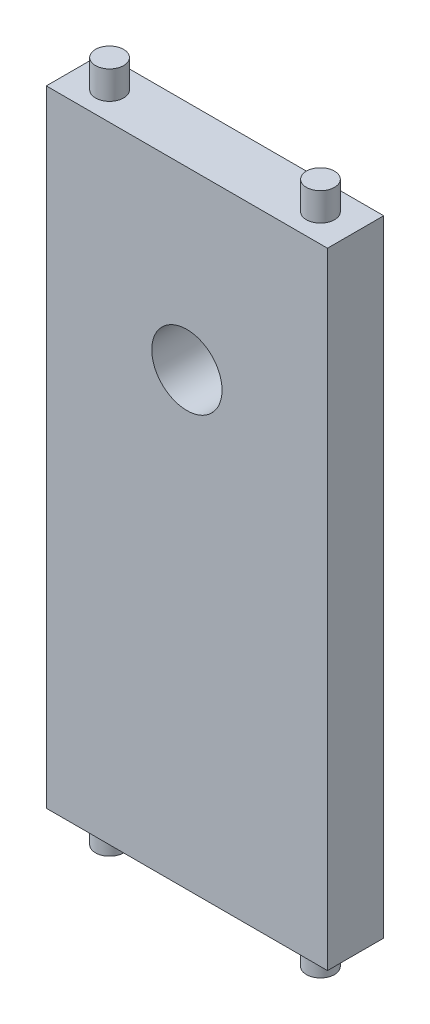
ISO-10303-21;
HEADER;
FILE_DESCRIPTION(('STEP AP214'),'2;1');
FILE_NAME('part.step','',(''),(''),'','','');
FILE_SCHEMA(('AUTOMOTIVE_DESIGN { 1 0 10303 214 1 1 1 1 }'));
ENDSEC;
DATA;
#1=APPLICATION_CONTEXT('core data for automotive mechanical design processes');
#2=APPLICATION_PROTOCOL_DEFINITION('international standard','automotive_design',2000,#1);
#3=PRODUCT_CONTEXT('',#1,'mechanical');
#4=PRODUCT('Part','Part','',(#3));
#5=PRODUCT_RELATED_PRODUCT_CATEGORY('part','',(#4));
#6=PRODUCT_DEFINITION_FORMATION('','',#4);
#7=PRODUCT_DEFINITION_CONTEXT('part definition',#1,'design');
#8=PRODUCT_DEFINITION('design','',#6,#7);
#9=PRODUCT_DEFINITION_SHAPE('','',#8);
#10=(LENGTH_UNIT() NAMED_UNIT(*) SI_UNIT(.MILLI.,.METRE.));
#11=(NAMED_UNIT(*) PLANE_ANGLE_UNIT() SI_UNIT($,.RADIAN.));
#12=(NAMED_UNIT(*) SI_UNIT($,.STERADIAN.) SOLID_ANGLE_UNIT());
#13=UNCERTAINTY_MEASURE_WITH_UNIT(LENGTH_MEASURE(1.E-05),#10,'distance_accuracy_value','');
#14=(GEOMETRIC_REPRESENTATION_CONTEXT(3) GLOBAL_UNCERTAINTY_ASSIGNED_CONTEXT((#13)) GLOBAL_UNIT_ASSIGNED_CONTEXT((#10,
#11,#12)) REPRESENTATION_CONTEXT('',''));
#15=CARTESIAN_POINT('',(0.,0.,0.));
#16=DIRECTION('',(0.,0.,1.));
#17=DIRECTION('',(1.,0.,0.));
#18=AXIS2_PLACEMENT_3D('',#15,#16,#17);
#19=CARTESIAN_POINT('',(-10.,22.25,4.));
#20=DIRECTION('',(0.,-1.,0.));
#21=DIRECTION('',(0.,0.,-1.));
#22=AXIS2_PLACEMENT_3D('',#19,#20,#21);
#23=PLANE('',#22);
#24=CARTESIAN_POINT('',(-7.5,22.25,2.));
#25=DIRECTION('',(0.,-1.,0.));
#26=DIRECTION('',(0.,0.,-1.));
#27=AXIS2_PLACEMENT_3D('',#24,#25,#26);
#28=CIRCLE('',#27,1.);
#29=CARTESIAN_POINT('',(-7.5,22.25,1.));
#30=VERTEX_POINT('',#29);
#31=EDGE_CURVE('E42',#30,#30,#28,.F.);
#32=ORIENTED_EDGE('',*,*,#31,.F.);
#33=EDGE_LOOP('',(#32));
#34=FACE_BOUND('',#33,.T.);
#35=DIRECTION('',(-1.,0.,0.));
#36=VECTOR('',#35,1.);
#37=CARTESIAN_POINT('',(-10.,22.25,0.));
#38=LINE('',#37,#36);
#39=CARTESIAN_POINT('',(9.99999999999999,22.25,0.));
#40=VERTEX_POINT('',#39);
#41=CARTESIAN_POINT('',(-10.,22.25,0.));
#42=VERTEX_POINT('',#41);
#43=EDGE_CURVE('E92',#40,#42,#38,.T.);
#44=ORIENTED_EDGE('',*,*,#43,.T.);
#45=DIRECTION('',(0.,0.,-1.));
#46=VECTOR('',#45,1.);
#47=CARTESIAN_POINT('',(-10.,22.25,4.));
#48=LINE('',#47,#46);
#49=CARTESIAN_POINT('',(-10.,22.25,4.));
#50=VERTEX_POINT('',#49);
#51=EDGE_CURVE('E90',#50,#42,#48,.T.);
#52=ORIENTED_EDGE('',*,*,#51,.F.);
#53=DIRECTION('',(-1.,0.,0.));
#54=VECTOR('',#53,1.);
#55=CARTESIAN_POINT('',(-10.,22.25,4.));
#56=LINE('',#55,#54);
#57=CARTESIAN_POINT('',(9.99999999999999,22.25,4.));
#58=VERTEX_POINT('',#57);
#59=EDGE_CURVE('E81',#58,#50,#56,.T.);
#60=ORIENTED_EDGE('',*,*,#59,.F.);
#61=DIRECTION('',(0.,0.,-1.));
#62=VECTOR('',#61,1.);
#63=CARTESIAN_POINT('',(9.99999999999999,22.25,4.));
#64=LINE('',#63,#62);
#65=EDGE_CURVE('E93',#58,#40,#64,.T.);
#66=ORIENTED_EDGE('',*,*,#65,.T.);
#67=EDGE_LOOP('',(#44,#52,#60,#66));
#68=FACE_BOUND('',#67,.T.);
#69=CARTESIAN_POINT('',(7.5,22.25,2.));
#70=DIRECTION('',(0.,-1.,0.));
#71=DIRECTION('',(0.,0.,-1.));
#72=AXIS2_PLACEMENT_3D('',#69,#70,#71);
#73=CIRCLE('',#72,1.);
#74=CARTESIAN_POINT('',(7.5,22.25,0.999999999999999));
#75=VERTEX_POINT('',#74);
#76=EDGE_CURVE('E11',#75,#75,#73,.F.);
#77=ORIENTED_EDGE('',*,*,#76,.F.);
#78=EDGE_LOOP('',(#77));
#79=FACE_BOUND('',#78,.T.);
#80=ADVANCED_FACE('F33',(#34,#68,#79),#23,.F.);
#81=CARTESIAN_POINT('',(0.,0.,4.));
#82=DIRECTION('',(0.,0.,-1.));
#83=DIRECTION('',(-1.,0.,0.));
#84=AXIS2_PLACEMENT_3D('',#81,#82,#83);
#85=PLANE('',#84);
#86=DIRECTION('',(0.,1.,0.));
#87=VECTOR('',#86,1.);
#88=CARTESIAN_POINT('',(9.99999999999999,-22.25,4.));
#89=LINE('',#88,#87);
#90=CARTESIAN_POINT('',(9.99999999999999,-22.25,4.));
#91=VERTEX_POINT('',#90);
#92=EDGE_CURVE('E87',#91,#58,#89,.T.);
#93=ORIENTED_EDGE('',*,*,#92,.T.);
#94=ORIENTED_EDGE('',*,*,#59,.T.);
#95=DIRECTION('',(0.,-1.,0.));
#96=VECTOR('',#95,1.);
#97=CARTESIAN_POINT('',(-10.,-22.25,4.));
#98=LINE('',#97,#96);
#99=CARTESIAN_POINT('',(-10.,-22.25,4.));
#100=VERTEX_POINT('',#99);
#101=EDGE_CURVE('E85',#50,#100,#98,.T.);
#102=ORIENTED_EDGE('',*,*,#101,.T.);
#103=DIRECTION('',(1.,0.,0.));
#104=VECTOR('',#103,1.);
#105=CARTESIAN_POINT('',(-10.,-22.25,4.));
#106=LINE('',#105,#104);
#107=EDGE_CURVE('E50',#100,#91,#106,.T.);
#108=ORIENTED_EDGE('',*,*,#107,.T.);
#109=EDGE_LOOP('',(#93,#94,#102,#108));
#110=FACE_BOUND('',#109,.T.);
#111=CARTESIAN_POINT('',(0.,9.74999999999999,4.));
#112=DIRECTION('',(0.,0.,1.));
#113=DIRECTION('',(1.,0.,0.));
#114=AXIS2_PLACEMENT_3D('',#111,#112,#113);
#115=CIRCLE('',#114,2.5);
#116=CARTESIAN_POINT('',(2.5,9.74999999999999,4.));
#117=VERTEX_POINT('',#116);
#118=EDGE_CURVE('E105',#117,#117,#115,.T.);
#119=ORIENTED_EDGE('',*,*,#118,.F.);
#120=EDGE_LOOP('',(#119));
#121=FACE_BOUND('',#120,.T.);
#122=ADVANCED_FACE('F82',(#110,#121),#85,.F.);
#123=CARTESIAN_POINT('',(0.,0.,0.));
#124=DIRECTION('',(0.,0.,-1.));
#125=DIRECTION('',(-1.,0.,0.));
#126=AXIS2_PLACEMENT_3D('',#123,#124,#125);
#127=PLANE('',#126);
#128=DIRECTION('',(0.,1.,0.));
#129=VECTOR('',#128,1.);
#130=CARTESIAN_POINT('',(9.99999999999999,-22.25,0.));
#131=LINE('',#130,#129);
#132=CARTESIAN_POINT('',(9.99999999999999,-22.25,0.));
#133=VERTEX_POINT('',#132);
#134=EDGE_CURVE('E102',#133,#40,#131,.T.);
#135=ORIENTED_EDGE('',*,*,#134,.F.);
#136=DIRECTION('',(1.,0.,0.));
#137=VECTOR('',#136,1.);
#138=CARTESIAN_POINT('',(-10.,-22.25,0.));
#139=LINE('',#138,#137);
#140=CARTESIAN_POINT('',(-10.,-22.25,0.));
#141=VERTEX_POINT('',#140);
#142=EDGE_CURVE('E73',#141,#133,#139,.T.);
#143=ORIENTED_EDGE('',*,*,#142,.F.);
#144=DIRECTION('',(0.,-1.,0.));
#145=VECTOR('',#144,1.);
#146=CARTESIAN_POINT('',(-10.,-22.25,0.));
#147=LINE('',#146,#145);
#148=EDGE_CURVE('E67',#42,#141,#147,.T.);
#149=ORIENTED_EDGE('',*,*,#148,.F.);
#150=ORIENTED_EDGE('',*,*,#43,.F.);
#151=EDGE_LOOP('',(#135,#143,#149,#150));
#152=FACE_BOUND('',#151,.T.);
#153=CARTESIAN_POINT('',(0.,9.74999999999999,0.));
#154=DIRECTION('',(0.,0.,1.));
#155=DIRECTION('',(1.,0.,0.));
#156=AXIS2_PLACEMENT_3D('',#153,#154,#155);
#157=CIRCLE('',#156,2.5);
#158=CARTESIAN_POINT('',(2.5,9.74999999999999,0.));
#159=VERTEX_POINT('',#158);
#160=EDGE_CURVE('E188',#159,#159,#157,.T.);
#161=ORIENTED_EDGE('',*,*,#160,.T.);
#162=EDGE_LOOP('',(#161));
#163=FACE_BOUND('',#162,.T.);
#164=ADVANCED_FACE('F120',(#152,#163),#127,.T.);
#165=CARTESIAN_POINT('',(9.99999999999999,-22.25,4.));
#166=DIRECTION('',(-1.,0.,0.));
#167=DIRECTION('',(0.,0.,1.));
#168=AXIS2_PLACEMENT_3D('',#165,#166,#167);
#169=PLANE('',#168);
#170=ORIENTED_EDGE('',*,*,#134,.T.);
#171=ORIENTED_EDGE('',*,*,#65,.F.);
#172=ORIENTED_EDGE('',*,*,#92,.F.);
#173=DIRECTION('',(0.,0.,-1.));
#174=VECTOR('',#173,1.);
#175=CARTESIAN_POINT('',(9.99999999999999,-22.25,4.));
#176=LINE('',#175,#174);
#177=EDGE_CURVE('E98',#91,#133,#176,.T.);
#178=ORIENTED_EDGE('',*,*,#177,.T.);
#179=EDGE_LOOP('',(#170,#171,#172,#178));
#180=FACE_BOUND('',#179,.T.);
#181=ADVANCED_FACE('F35',(#180),#169,.F.);
#182=CARTESIAN_POINT('',(-10.,-22.25,4.));
#183=DIRECTION('',(1.,0.,0.));
#184=DIRECTION('',(0.,0.,-1.));
#185=AXIS2_PLACEMENT_3D('',#182,#183,#184);
#186=PLANE('',#185);
#187=ORIENTED_EDGE('',*,*,#148,.T.);
#188=DIRECTION('',(0.,0.,-1.));
#189=VECTOR('',#188,1.);
#190=CARTESIAN_POINT('',(-10.,-22.25,4.));
#191=LINE('',#190,#189);
#192=EDGE_CURVE('E94',#100,#141,#191,.T.);
#193=ORIENTED_EDGE('',*,*,#192,.F.);
#194=ORIENTED_EDGE('',*,*,#101,.F.);
#195=ORIENTED_EDGE('',*,*,#51,.T.);
#196=EDGE_LOOP('',(#187,#193,#194,#195));
#197=FACE_BOUND('',#196,.T.);
#198=ADVANCED_FACE('F96',(#197),#186,.F.);
#199=CARTESIAN_POINT('',(-10.,-22.25,4.));
#200=DIRECTION('',(0.,1.,0.));
#201=DIRECTION('',(0.,0.,1.));
#202=AXIS2_PLACEMENT_3D('',#199,#200,#201);
#203=PLANE('',#202);
#204=CARTESIAN_POINT('',(7.5,-22.25,2.));
#205=DIRECTION('',(0.,1.,0.));
#206=DIRECTION('',(0.,0.,1.));
#207=AXIS2_PLACEMENT_3D('',#204,#205,#206);
#208=CIRCLE('',#207,1.);
#209=CARTESIAN_POINT('',(7.5,-22.25,3.));
#210=VERTEX_POINT('',#209);
#211=EDGE_CURVE('E172',#210,#210,#208,.T.);
#212=ORIENTED_EDGE('',*,*,#211,.T.);
#213=EDGE_LOOP('',(#212));
#214=FACE_BOUND('',#213,.T.);
#215=CARTESIAN_POINT('',(-7.5,-22.25,2.));
#216=DIRECTION('',(0.,1.,0.));
#217=DIRECTION('',(0.,0.,1.));
#218=AXIS2_PLACEMENT_3D('',#215,#216,#217);
#219=CIRCLE('',#218,1.);
#220=CARTESIAN_POINT('',(-7.5,-22.25,3.));
#221=VERTEX_POINT('',#220);
#222=EDGE_CURVE('E171',#221,#221,#219,.T.);
#223=ORIENTED_EDGE('',*,*,#222,.T.);
#224=EDGE_LOOP('',(#223));
#225=FACE_BOUND('',#224,.T.);
#226=ORIENTED_EDGE('',*,*,#142,.T.);
#227=ORIENTED_EDGE('',*,*,#177,.F.);
#228=ORIENTED_EDGE('',*,*,#107,.F.);
#229=ORIENTED_EDGE('',*,*,#192,.T.);
#230=EDGE_LOOP('',(#226,#227,#228,#229));
#231=FACE_BOUND('',#230,.T.);
#232=ADVANCED_FACE('F125',(#214,#225,#231),#203,.F.);
#233=CARTESIAN_POINT('',(0.,9.74999999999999,4.));
#234=DIRECTION('',(0.,0.,-1.));
#235=DIRECTION('',(-1.,0.,0.));
#236=AXIS2_PLACEMENT_3D('',#233,#234,#235);
#237=CYLINDRICAL_SURFACE('',#236,2.5);
#238=ORIENTED_EDGE('',*,*,#118,.T.);
#239=EDGE_LOOP('',(#238));
#240=FACE_BOUND('',#239,.T.);
#241=ORIENTED_EDGE('',*,*,#160,.F.);
#242=EDGE_LOOP('',(#241));
#243=FACE_BOUND('',#242,.T.);
#244=ADVANCED_FACE('F128',(#240,#243),#237,.F.);
#245=CARTESIAN_POINT('',(-7.5,24.25,2.));
#246=DIRECTION('',(0.,-1.,0.));
#247=DIRECTION('',(0.,0.,-1.));
#248=AXIS2_PLACEMENT_3D('',#245,#246,#247);
#249=CYLINDRICAL_SURFACE('',#248,1.);
#250=CARTESIAN_POINT('',(-7.5,24.25,2.));
#251=DIRECTION('',(0.,1.,0.));
#252=DIRECTION('',(0.,0.,1.));
#253=AXIS2_PLACEMENT_3D('',#250,#251,#252);
#254=CIRCLE('',#253,1.);
#255=CARTESIAN_POINT('',(-7.5,24.25,3.));
#256=VERTEX_POINT('',#255);
#257=EDGE_CURVE('E185',#256,#256,#254,.T.);
#258=ORIENTED_EDGE('',*,*,#257,.F.);
#259=EDGE_LOOP('',(#258));
#260=FACE_BOUND('',#259,.T.);
#261=ORIENTED_EDGE('',*,*,#31,.T.);
#262=EDGE_LOOP('',(#261));
#263=FACE_BOUND('',#262,.T.);
#264=ADVANCED_FACE('F114',(#260,#263),#249,.T.);
#265=CARTESIAN_POINT('',(-7.5,24.25,2.));
#266=DIRECTION('',(0.,1.,0.));
#267=DIRECTION('',(0.,0.,1.));
#268=AXIS2_PLACEMENT_3D('',#265,#266,#267);
#269=PLANE('',#268);
#270=ORIENTED_EDGE('',*,*,#257,.T.);
#271=EDGE_LOOP('',(#270));
#272=FACE_BOUND('',#271,.T.);
#273=ADVANCED_FACE('F138',(#272),#269,.T.);
#274=CARTESIAN_POINT('',(7.5,24.25,2.));
#275=DIRECTION('',(0.,-1.,0.));
#276=DIRECTION('',(0.,0.,-1.));
#277=AXIS2_PLACEMENT_3D('',#274,#275,#276);
#278=CYLINDRICAL_SURFACE('',#277,1.);
#279=CARTESIAN_POINT('',(7.5,24.25,2.));
#280=DIRECTION('',(0.,1.,0.));
#281=DIRECTION('',(0.,0.,1.));
#282=AXIS2_PLACEMENT_3D('',#279,#280,#281);
#283=CIRCLE('',#282,1.);
#284=CARTESIAN_POINT('',(7.5,24.25,3.));
#285=VERTEX_POINT('',#284);
#286=EDGE_CURVE('E181',#285,#285,#283,.T.);
#287=ORIENTED_EDGE('',*,*,#286,.F.);
#288=EDGE_LOOP('',(#287));
#289=FACE_BOUND('',#288,.T.);
#290=ORIENTED_EDGE('',*,*,#76,.T.);
#291=EDGE_LOOP('',(#290));
#292=FACE_BOUND('',#291,.T.);
#293=ADVANCED_FACE('F142',(#289,#292),#278,.T.);
#294=CARTESIAN_POINT('',(7.5,24.25,2.));
#295=DIRECTION('',(0.,1.,0.));
#296=DIRECTION('',(0.,0.,1.));
#297=AXIS2_PLACEMENT_3D('',#294,#295,#296);
#298=PLANE('',#297);
#299=ORIENTED_EDGE('',*,*,#286,.T.);
#300=EDGE_LOOP('',(#299));
#301=FACE_BOUND('',#300,.T.);
#302=ADVANCED_FACE('F146',(#301),#298,.T.);
#303=CARTESIAN_POINT('',(-7.5,-24.25,2.));
#304=DIRECTION('',(0.,1.,0.));
#305=DIRECTION('',(0.,0.,1.));
#306=AXIS2_PLACEMENT_3D('',#303,#304,#305);
#307=CYLINDRICAL_SURFACE('',#306,1.);
#308=CARTESIAN_POINT('',(-7.5,-24.25,2.));
#309=DIRECTION('',(0.,1.,0.));
#310=DIRECTION('',(0.,0.,1.));
#311=AXIS2_PLACEMENT_3D('',#308,#309,#310);
#312=CIRCLE('',#311,1.);
#313=CARTESIAN_POINT('',(-7.5,-24.25,3.));
#314=VERTEX_POINT('',#313);
#315=EDGE_CURVE('E175',#314,#314,#312,.T.);
#316=ORIENTED_EDGE('',*,*,#315,.T.);
#317=EDGE_LOOP('',(#316));
#318=FACE_BOUND('',#317,.T.);
#319=ORIENTED_EDGE('',*,*,#222,.F.);
#320=EDGE_LOOP('',(#319));
#321=FACE_BOUND('',#320,.T.);
#322=ADVANCED_FACE('F150',(#318,#321),#307,.T.);
#323=CARTESIAN_POINT('',(-7.5,-24.25,2.));
#324=DIRECTION('',(0.,-1.,0.));
#325=DIRECTION('',(0.,0.,1.));
#326=AXIS2_PLACEMENT_3D('',#323,#324,#325);
#327=PLANE('',#326);
#328=ORIENTED_EDGE('',*,*,#315,.F.);
#329=EDGE_LOOP('',(#328));
#330=FACE_BOUND('',#329,.T.);
#331=ADVANCED_FACE('F154',(#330),#327,.T.);
#332=CARTESIAN_POINT('',(7.5,-24.25,2.));
#333=DIRECTION('',(0.,1.,0.));
#334=DIRECTION('',(0.,0.,1.));
#335=AXIS2_PLACEMENT_3D('',#332,#333,#334);
#336=CYLINDRICAL_SURFACE('',#335,1.);
#337=CARTESIAN_POINT('',(7.5,-24.25,2.));
#338=DIRECTION('',(0.,1.,0.));
#339=DIRECTION('',(0.,0.,1.));
#340=AXIS2_PLACEMENT_3D('',#337,#338,#339);
#341=CIRCLE('',#340,1.);
#342=CARTESIAN_POINT('',(7.5,-24.25,3.));
#343=VERTEX_POINT('',#342);
#344=EDGE_CURVE('E170',#343,#343,#341,.T.);
#345=ORIENTED_EDGE('',*,*,#344,.T.);
#346=EDGE_LOOP('',(#345));
#347=FACE_BOUND('',#346,.T.);
#348=ORIENTED_EDGE('',*,*,#211,.F.);
#349=EDGE_LOOP('',(#348));
#350=FACE_BOUND('',#349,.T.);
#351=ADVANCED_FACE('F158',(#347,#350),#336,.T.);
#352=CARTESIAN_POINT('',(7.5,-24.25,2.));
#353=DIRECTION('',(0.,-1.,0.));
#354=DIRECTION('',(0.,0.,1.));
#355=AXIS2_PLACEMENT_3D('',#352,#353,#354);
#356=PLANE('',#355);
#357=ORIENTED_EDGE('',*,*,#344,.F.);
#358=EDGE_LOOP('',(#357));
#359=FACE_BOUND('',#358,.T.);
#360=ADVANCED_FACE('F162',(#359),#356,.T.);
#361=CLOSED_SHELL('',(#80,#122,#164,#181,#198,#232,#244,#264,#273,#293,#302,#322,#331,#351,#360));
#362=MANIFOLD_SOLID_BREP('B2',#361);
#363=ADVANCED_BREP_SHAPE_REPRESENTATION('',(#18,#362),#14);
#364=SHAPE_DEFINITION_REPRESENTATION(#9,#363);
ENDSEC;
END-ISO-10303-21;
